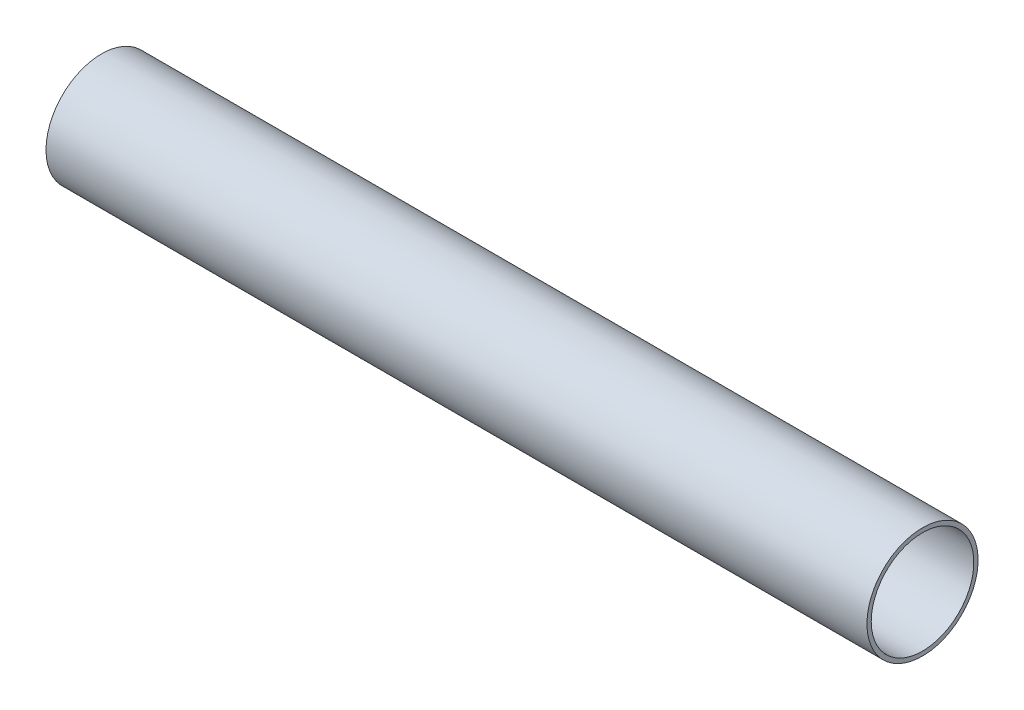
from build123d import *

# Parameters (mm, degrees)
SKETCH1_R      = 20.6375
SKETCH1_R_2    = 19.05
EXTRUDE1_DEPTH = 304.8


with BuildPart() as part:
    # Sketch1 → Extrude1 (new body)
    with BuildSketch(Plane(origin=(0, 0, 0), x_dir=(0, 0, -1), z_dir=(1, 0, 0))):
        with Locations(Location((0, 0, 0), (0, 0, 180))):
            Circle(SKETCH1_R)
        with Locations(Location((0, 0, 0), (0, 0, 180))):
            Circle(SKETCH1_R_2, mode=Mode.SUBTRACT)
    extrude(amount=EXTRUDE1_DEPTH)


solid = part.part
